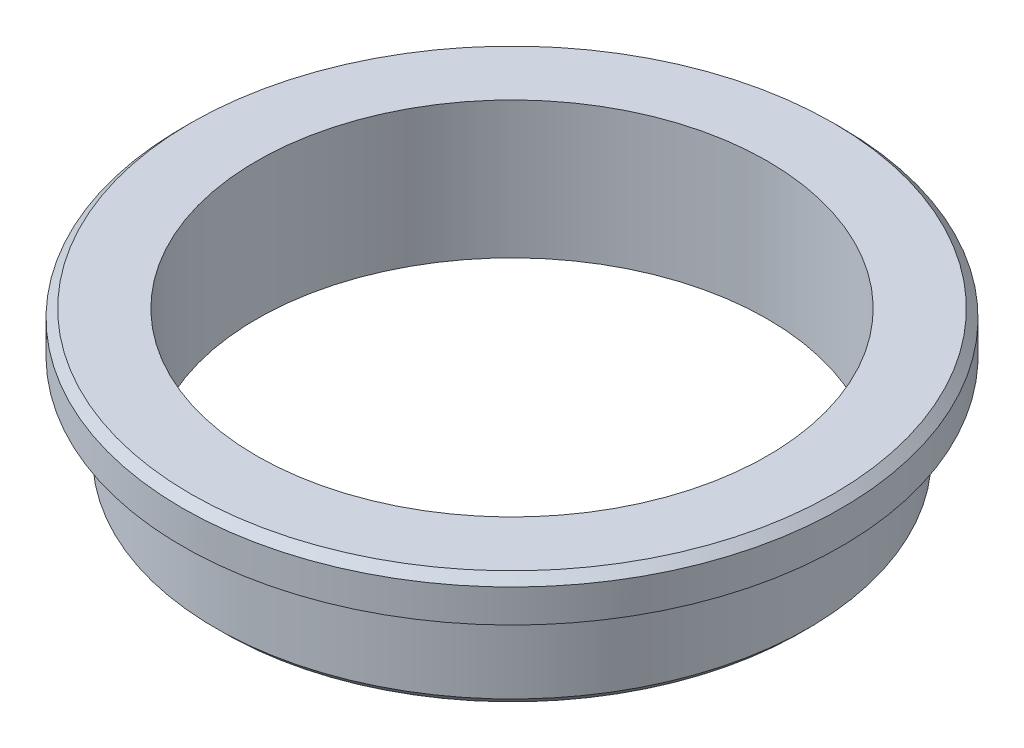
from build123d import *

# Parameters (mm, degrees)
CHANFREIN1_SIZE = 0.5


with BuildPart() as part:
    # Esquisse1 → R_volution1 (revolve)
    with BuildSketch(Plane.XY, mode=Mode.PRIVATE) as r_volution1_sk:
        Polygon((15.5, 2.5), (20, 2.5), (20, 0), (18, 0), (18, -5.8), (15.5, -5.8), align=None)
    revolve(r_volution1_sk.sketch.rotate(Axis((0, 0, 0), (0, 1, 0)), 90), axis=Axis((0, 0, 0), (0, 1, 0)))

    # Chanfrein1
    chanfrein1_edges = [part.edges().sort_by_distance(p)[0] for p in [
        (0, -5.8, 18),
        (0, 2.5, 20),
    ]]
    chamfer(chanfrein1_edges, length=CHANFREIN1_SIZE)


solid = part.part
